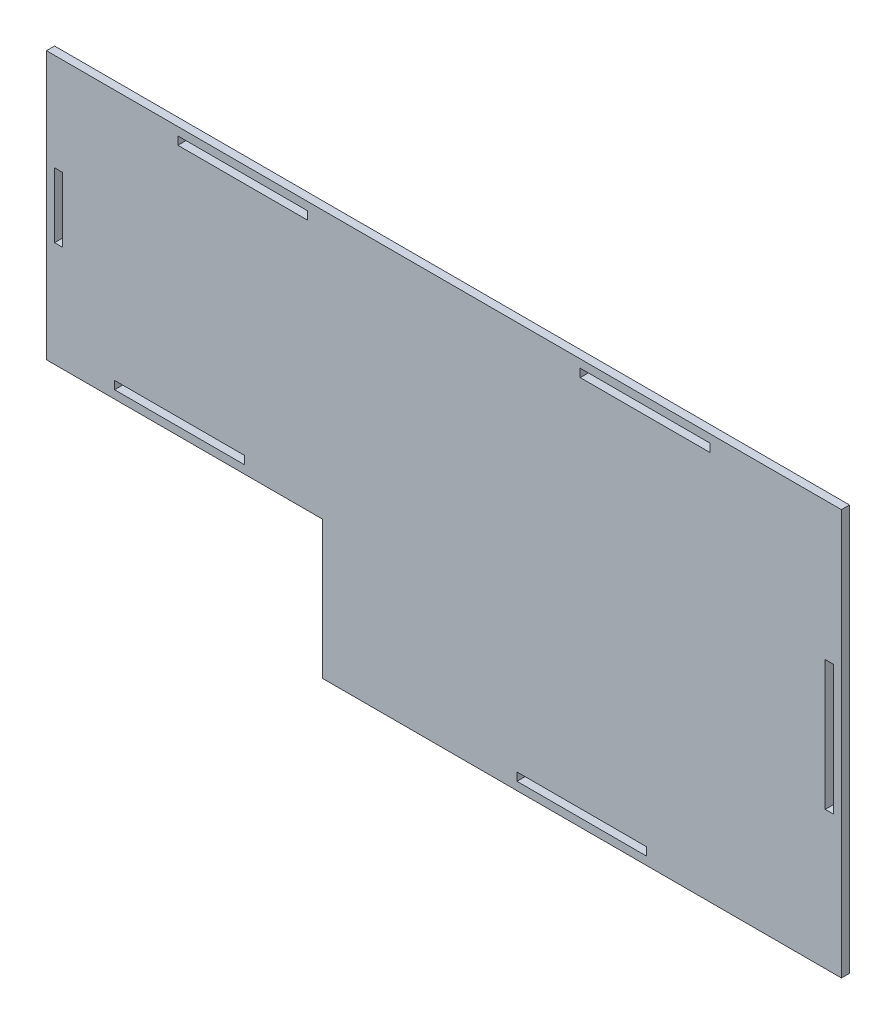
from build123d import *

# Parameters (mm, degrees)
SKETCH1_W           = 50.8
SKETCH1_H           = 3.175
SKETCH1_W_2         = 3.175
SKETCH1_H_2         = 25.4
SKETCH1_H_3         = 50.8
BOSS_EXTRUDE1_DEPTH = 3.175


with BuildPart() as part:
    # Sketch1 → Boss-Extrude1 (new body)
    with BuildSketch(Plane.XY):
        Polygon((-87.334836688, 2.752334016), (-87.334836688, -51.222665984), (115.865163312, -51.222665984), (115.865163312, 107.527334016), (-195.284836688, 107.527334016), (-195.284836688, 2.752334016), align=None)
        with Locations((-143.214836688, 7.514834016)):
            Rectangle(SKETCH1_W, SKETCH1_H, mode=Mode.SUBTRACT)
        with Locations((-190.522336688, 56.727334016)):
            Rectangle(SKETCH1_W_2, SKETCH1_H_2, mode=Mode.SUBTRACT)
        with Locations((14.265163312, -46.460165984)):
            Rectangle(SKETCH1_W, SKETCH1_H, mode=Mode.SUBTRACT)
        with Locations((111.102663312, 28.152334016)):
            Rectangle(SKETCH1_W_2, SKETCH1_H_3, mode=Mode.SUBTRACT)
        with Locations((-118.449836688, 102.764834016)):
            Rectangle(SKETCH1_W, SKETCH1_H, mode=Mode.SUBTRACT)
        with Locations((39.030163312, 102.764834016)):
            Rectangle(SKETCH1_W, SKETCH1_H, mode=Mode.SUBTRACT)
    extrude(amount=BOSS_EXTRUDE1_DEPTH)


solid = part.part
